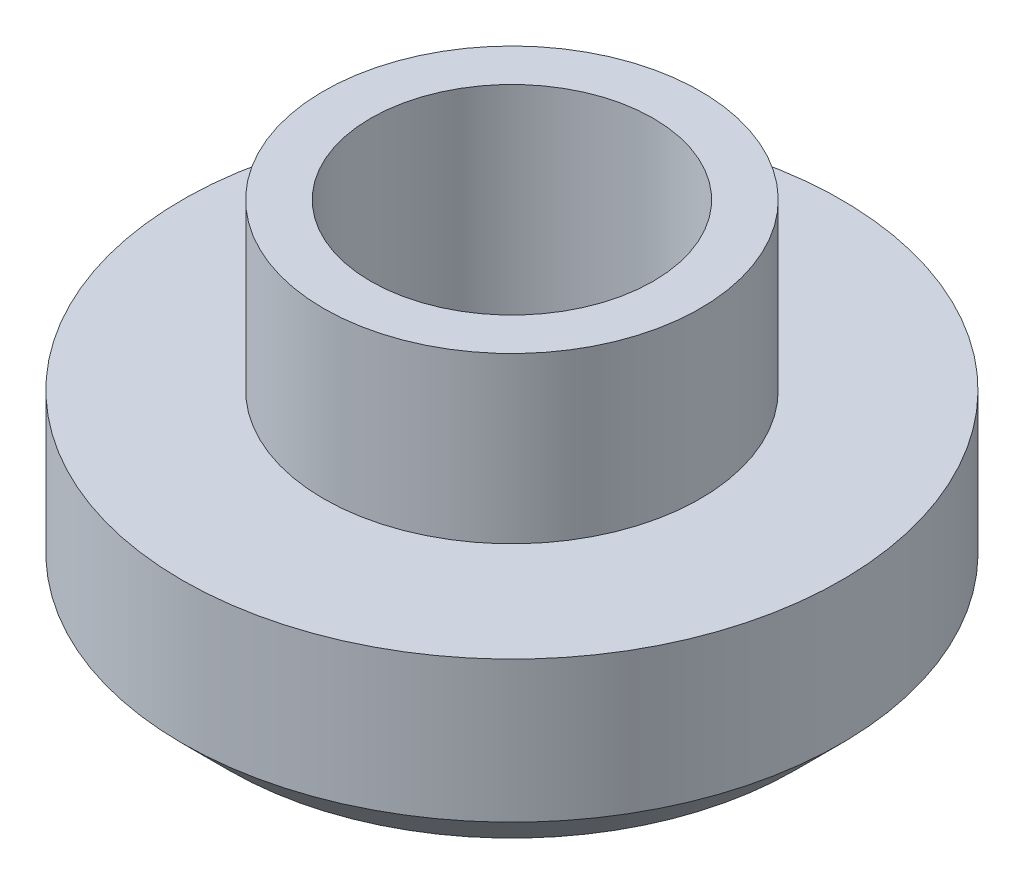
from build123d import *

# Parameters (mm, degrees)
SKETCH1_R      = 7
EXTRUDE1_DEPTH = 4
SKETCH2_R      = 4
EXTRUDE2_DEPTH = 3.5
SKETCH3_R      = 3
EXTRUDE3_DEPTH = 13.419742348
CHAMFER1_SIZE  = 1


with BuildPart() as part:
    # Sketch1 → Extrude1 (new body)
    with BuildSketch(Plane(origin=(0, 0, 0), x_dir=(1, 0, 0), z_dir=(0, 1, 0))):
        with Locations(Location((0, 0, 0), (0, 0, 270))):
            Circle(SKETCH1_R)
    extrude(amount=EXTRUDE1_DEPTH)

    # Sketch2 → Extrude2 (add)
    with BuildSketch(Plane(origin=(0, 4, 0), x_dir=(1, 0, 0), z_dir=(0, 1, 0))):
        with Locations(Location((0, 0, 0), (0, 0, 270))):
            Circle(SKETCH2_R)
    extrude(amount=EXTRUDE2_DEPTH)

    # Sketch3 → Extrude3 (cut, through all)
    with BuildSketch(Plane(origin=(0, 7.5, 0), x_dir=(1, 0, 0), z_dir=(0, 1, 0))):
        with Locations(Location((0, 0, 0), (0, 0, 270))):
            Circle(SKETCH3_R)
    extrude(amount=-EXTRUDE3_DEPTH, mode=Mode.SUBTRACT)

    # Chamfer1
    chamfer1_edges = [part.edges().sort_by_distance(p)[0] for p in [
        (0, 0, -7),
    ]]
    chamfer(chamfer1_edges, length=CHAMFER1_SIZE)


solid = part.part
